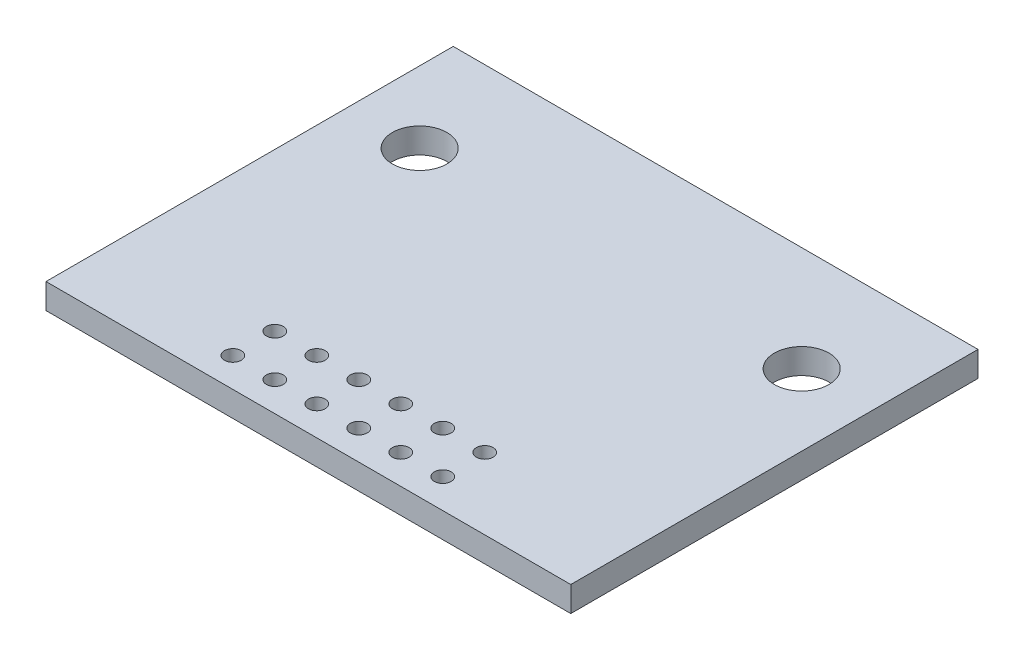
from build123d import *

# Parameters (mm, degrees)
SKETCH1_W      = 31.75
SKETCH1_H      = 24.638
SKETCH1_R      = 0.508
SKETCH1_R_2    = 1.651
EXTRUDE1_DEPTH = 1.524


with BuildPart() as part:
    # Sketch1 → Extrude1 (new body)
    with BuildSketch(Plane(origin=(0, 0, 0), x_dir=(1, 0, 0), z_dir=(0, 1, 0))):
        with Locations((15.875, 12.319)):
            Rectangle(SKETCH1_W, SKETCH1_H)
        with Locations(Location((9.525, 1.778, 0), (0, 0, 270))):
            Circle(SKETCH1_R, mode=Mode.SUBTRACT)
        with Locations(Location((12.065, 1.778, 0), (0, 0, 270))):
            Circle(SKETCH1_R, mode=Mode.SUBTRACT)
        with Locations(Location((14.605, 1.778, 0), (0, 0, 270))):
            Circle(SKETCH1_R, mode=Mode.SUBTRACT)
        with Locations(Location((17.145, 1.778, 0), (0, 0, 270))):
            Circle(SKETCH1_R, mode=Mode.SUBTRACT)
        with Locations(Location((19.685, 1.778, 0), (0, 0, 270))):
            Circle(SKETCH1_R, mode=Mode.SUBTRACT)
        with Locations(Location((19.685, 4.318, 0), (0, 0, 270))):
            Circle(SKETCH1_R, mode=Mode.SUBTRACT)
        with Locations(Location((17.145, 4.318, 0), (0, 0, 270))):
            Circle(SKETCH1_R, mode=Mode.SUBTRACT)
        with Locations(Location((14.605, 4.318, 0), (0, 0, 270))):
            Circle(SKETCH1_R, mode=Mode.SUBTRACT)
        with Locations(Location((12.065, 4.318, 0), (0, 0, 270))):
            Circle(SKETCH1_R, mode=Mode.SUBTRACT)
        with Locations(Location((9.525, 4.318, 0), (0, 0, 270))):
            Circle(SKETCH1_R, mode=Mode.SUBTRACT)
        with Locations(Location((22.225, 1.778, 0), (0, 0, 270))):
            Circle(SKETCH1_R, mode=Mode.SUBTRACT)
        with Locations(Location((22.225, 4.318, 0), (0, 0, 270))):
            Circle(SKETCH1_R, mode=Mode.SUBTRACT)
        with Locations(Location((4.318, 18.288, 0), (0, 0, 90))):
            Circle(SKETCH1_R_2, mode=Mode.SUBTRACT)
        with Locations(Location((27.432, 18.288, 0), (0, 0, 90))):
            Circle(SKETCH1_R_2, mode=Mode.SUBTRACT)
    extrude(amount=EXTRUDE1_DEPTH)


solid = part.part
